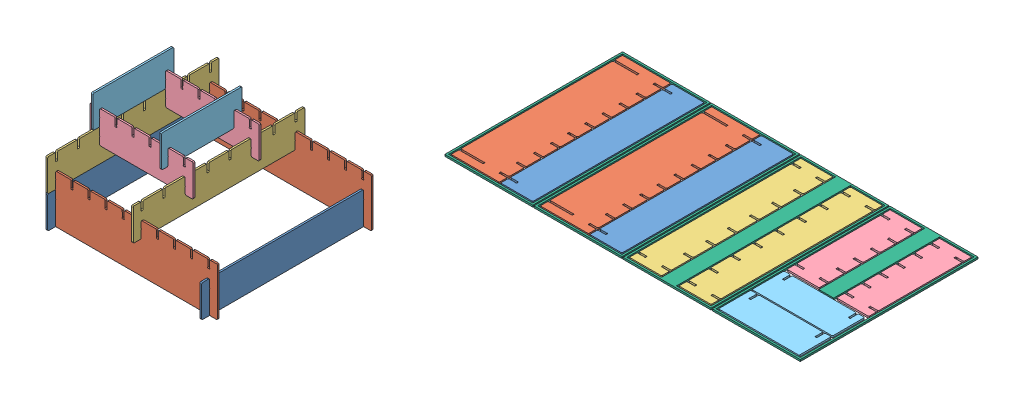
SolidWorks assembly grogrid.SLDASM, configuration Default (file format 8000). Lengths in mm.
Overall size (3424.06 662.4 3027.4).
21 component instances, 6 part files, 60 mates.
Components (placement in the parent):
- front-1: front.SLDPRT [Défaut] at (973.95 0 -1198.5) x (0 0 1) z (0 1 0) size (1177 220.8 12)
- side-1: side.SLDPRT [Défaut] at (633.75 12 -21.5) x (0 0 -1) z (0 -1 0) size (1177 331.2 12)
- front_level1-1: front_level1.SLDPRT [Défaut] at (1585.95 0 -1198.5) x (0 0 1) z (0 1 0) size (1177 220.8 12)
- front-2: front.SLDPRT [Défaut] at (361.95 0 -1198.5) x (0 0 1) z (0 1 0) size (1177 220.8 12)
- side-2: side.SLDPRT [Défaut] at (21.75 12 -21.5) x (0 0 -1) z (0 -1 0) size (1177 331.2 12)
- front_level1-2: front_level1.SLDPRT [Défaut] at (1466.55 0 -21.5) x (0 0 -1) z (0 1 0) size (1177 220.8 12)
- part_level2-1: part_level2.SLDPRT [Défaut] at (2078.55 0 -491.2778) x (0 0 -1) z (0 1 0) size (707.22 220.8 12)
- part_level3-1: part_level3.SLDPRT [Défaut] at (1857.75 12 -471.6) x (1 0 0) z (0 -1 0) size (553 220.8 12)
- part_level2-3: part_level2.SLDPRT [Défaut] at (2197.95 0 -1198.5) x (0 0 1) z (0 1 0) size (707.22 220.8 12)
- part_level3-2: part_level3.SLDPRT [Défaut] at (1857.75 12 -242.3) x (1 0 0) z (0 -1 0) size (553 220.8 12)
- layout-1: layout.SLDPRT [Default] at (0.25 0 0) size (2440 12 1220)
- front-3: front.SLDPRT [Défaut] at (-929.8123 220.8 630.4026) x (0 0 1) z (1 0 0) size (1177 220.8 12)
- front-4: front.SLDPRT [Défaut] at (127.1877 220.8 630.4026) x (0 0 1) z (1 0 0) size (1177 220.8 12)
- side-3: side.SLDPRT [Défaut] at (-983.8123 0 1741.4026) size (1177 331.2 12)
- side-4: side.SLDPRT [Défaut] at (-983.8123 0 684.4026) size (1177 331.2 12)
- front_level1-3: front_level1.SLDPRT [Défaut] at (-330.5901 441.6 1807.4026) x (0 0 -1) z (-1 0 0) size (1177 220.8 12)
- front_level1-4: front_level1.SLDPRT [Défaut] at (-917.8123 441.6 1807.4026) x (0 0 -1) z (-1 0 0) size (1177 220.8 12)
- part_level2-4: part_level2.SLDPRT [Défaut] at (-983.8123 552 998.4026) x (1 0 0) z (0 0 -1) size (707.22 220.8 12)
- part_level2-5: part_level2.SLDPRT [Défaut] at (-983.8123 552 1451.4026) x (1 0 0) z (0 0 -1) size (707.22 220.8 12)
- part_level3-3: part_level3.SLDPRT [Défaut] at (-917.8123 441.6 942.4026) x (0 0 1) z (-1 0 0) size (553 220.8 12)
- part_level3-4: part_level3.SLDPRT [Défaut] at (-448.0346 441.6 942.4026) x (0 0 1) z (-1 0 0) size (553 220.8 12)
Mates (geometry in assembly coordinates):
- Coincident2: coincident anti-aligned: plane of front-1 through (973.95 0 -1198.5) normal (0 -1 0); plane of assembly through (0 0 0) normal (0 1 0)
- Coincident3: coincident anti-aligned: plane of part_level3-1 through (1857.75 0 -471.6) normal (0 -1 0); plane of assembly through (0 0 0) normal (0 1 0)
- Coincident4: coincident anti-aligned: plane of side-2 through (21.75 0 -21.5) normal (0 -1 0); plane of assembly through (0 0 0) normal (0 1 0)
- Coincident5: coincident anti-aligned: plane of part_level2-3 through (2197.95 0 -1198.5) normal (0 -1 0); plane of assembly through (0 0 0) normal (0 1 0)
- Coincident6: coincident anti-aligned: plane of part_level3-2 through (1857.75 0 -242.3) normal (0 -1 0); plane of assembly through (0 0 0) normal (0 1 0)
- Coincident7: coincident anti-aligned: plane of front_level1-1 through (1585.95 0 -1198.5) normal (0 -1 0); plane of assembly through (0 0 0) normal (0 1 0)
- Coincident8: coincident anti-aligned: plane of side-1 through (633.75 0 -21.5) normal (0 -1 0); plane of assembly through (0 0 0) normal (0 1 0)
- Coincident9: coincident anti-aligned: plane of front_level1-2 through (1466.55 0 -21.5) normal (0 -1 0); plane of assembly through (0 0 0) normal (0 1 0)
- Coincident10: coincident anti-aligned: plane of part_level2-1 through (2078.55 0 -491.2778) normal (0 -1 0); plane of assembly through (0 0 0) normal (0 1 0)
- Coincident11: coincident anti-aligned: plane of front-2 through (361.95 0 -1198.5) normal (0 -1 0); plane of assembly through (0 0 0) normal (0 1 0)
- Coincident14: coincident anti-aligned: line of side-2 through (345.95 0 -1198.5) axis (-1 0 0); line of layout-1 through (21.75 0 -1198.5) axis (1 0 0)
- Coincident15: coincident anti-aligned: line of side-2 through (21.75 0 -94.9831) axis (0 0 -1); line of layout-1 through (21.75 0 -1198.5) axis (0 0 1)
- Coincident16: coincident anti-aligned: line of front-2 through (582.75 0 -28.5) axis (0 0 -1); line of layout-1 through (582.75 0 -1198.5) axis (0 0 1)
- Coincident17: coincident anti-aligned: line of front-2 through (575.75 0 -1198.5) axis (-1 0 0); line of layout-1 through (21.75 0 -1198.5) axis (1 0 0)
- Coincident18: coincident anti-aligned: line of side-1 through (633.75 0 -94.9831) axis (0 0 -1); line of layout-1 through (633.75 0 -1198.5) axis (0 0 1)
- Coincident19: coincident anti-aligned: line of side-1 through (957.95 0 -1198.5) axis (-1 0 0); line of layout-1 through (633.75 0 -1198.5) axis (1 0 0)
- Coincident21: coincident anti-aligned: line of front-1 through (1194.75 0 -28.5) axis (0 0 -1); line of layout-1 through (1194.75 0 -1198.5) axis (0 0 1)
- Coincident22: coincident anti-aligned: line of front-1 through (1187.75 0 -1198.5) axis (-1 0 0); line of layout-1 through (633.75 0 -1198.5) axis (1 0 0)
- Coincident23: coincident anti-aligned: line of front_level1-2 through (1245.75 0 -1125.0505) axis (0 0 1); line of layout-1 through (1245.75 0 -21.5) axis (0 0 -1)
- Coincident24: coincident aligned: line of front_level1-2 through (1252.75 0 -1198.5) axis (1 0 0); line of layout-1 through (1245.75 0 -1198.5) axis (1 0 0)
- Coincident25: coincident aligned: line of front_level1-1 through (1806.75 0 -94.9495) axis (0 0 -1); line of layout-1 through (1806.75 0 -21.5) axis (0 0 -1)
- Coincident26: coincident anti-aligned: line of front_level1-1 through (1799.75 0 -1198.5) axis (-1 0 0); line of layout-1 through (1245.75 0 -1198.5) axis (1 0 0)
- Coincident27: coincident aligned: line of part_level2-1 through (1857.75 0 -1125.0505) axis (0 0 1); line of layout-1 through (1857.75 0 -1198.5) axis (0 0 1)
- Coincident28: coincident aligned: line of part_level2-1 through (1864.75 0 -1198.5) axis (1 0 0); line of layout-1 through (1857.75 0 -1198.5) axis (1 0 0)
- Coincident29: coincident anti-aligned: line of part_level2-3 through (2418.75 0 -564.7272) axis (0 0 -1); line of layout-1 through (2418.75 0 -1198.5) axis (0 0 1)
- Coincident30: coincident anti-aligned: line of part_level2-3 through (2411.75 0 -1198.5) axis (-1 0 0); line of layout-1 through (1857.75 0 -1198.5) axis (1 0 0)
- Coincident31: coincident anti-aligned: line of part_level3-2 through (2403.75 0 -21.5) axis (-1 0 0); line of layout-1 through (1857.75 0 -21.5) axis (1 0 0)
- Coincident32: coincident anti-aligned: line of part_level3-2 through (1857.75 0 -28.5) axis (0 0 -1); line of layout-1 through (1857.75 0 -1198.5) axis (0 0 1)
- Distance3: distance anti-aligned: plane of part_level3-1 through (1857.75 0 -250.8) normal (0 0 1); plane of part_level3-2 through (1857.75 0 -242.3) normal (0 0 -1)
- Coincident34: coincident anti-aligned: line of part_level3-1 through (1857.75 0 -257.8) axis (0 0 -1); line of layout-1 through (1857.75 0 -1198.5) axis (0 0 1)
- Coincident35: coordinate: point of ?; point of assembly
- Coincident36: coincident anti-aligned: plane of front-3 through (-917.8123 0 630.4026) normal (0 -1 0); plane of assembly through (0 0 0) normal (0 1 0)
- Parallel1: parallel aligned: plane of front-3 through (-917.8123 220.8 630.4026) normal (1 0 0); plane of assembly through (0 0 0) normal (1 0 0)
- Coincident38: coincident anti-aligned: plane of front-4 through (139.1877 0 630.4026) normal (0 -1 0); plane of assembly through (0 0 0) normal (0 1 0)
- Coincident39: coincident aligned: plane of front-3 through (-917.8123 220.8 1807.4026) normal (0 0 1); plane of front-4 through (139.1877 220.8 1807.4026) normal (0 0 1)
- Width2: width anti-aligned: plane of front-3 through (-929.8123 172.094 1741.2556) normal (0 0.007246 0.999974); plane of front-3 through (-929.8123 172.094 1753.5497) normal (0 0.007246 -0.999974); plane of side-3 through (-983.8123 0 1753.4026) normal (0 0 1); plane of side-3 through (-983.8123 0 1741.4026) normal (0 0 -1)
- Coincident40: coincident anti-aligned: plane of front-3 through (-929.8123 165.6 1747.5353) normal (0 1 0); plane of side-3 through (-923.945 165.6 1741.4026) normal (0 -1 0)
- Width3: width aligned: plane of front-3 through (-917.8123 220.8 630.4026) normal (1 0 0); plane of front-3 through (-929.8123 220.8 630.4026) normal (-1 0 0); plane of side-3 through (-917.6966 159.0758 1741.4026) normal (-0.999997 -0.002415 0); plane of side-3 through (-929.9281 159.0758 1741.4026) normal (0.999997 -0.002415 0)
- Width4: width aligned: plane of side-3 through (139.3034 159.0758 1741.4026) normal (-0.999997 -0.002415 0); plane of side-3 through (127.0719 159.0758 1741.4026) normal (0.999997 -0.002415 0); plane of front-4 through (139.1877 220.8 630.4026) normal (1 0 0); plane of front-4 through (127.1877 220.8 630.4026) normal (-1 0 0)
- Width6: width anti-aligned: plane of side-4 through (-929.9281 159.0758 684.4026) normal (0.999997 -0.002415 0); plane of side-4 through (-917.6966 159.0758 684.4026) normal (-0.999997 -0.002415 0); plane of front-3 through (-917.8123 220.8 630.4026) normal (1 0 0); plane of front-3 through (-929.8123 220.8 630.4026) normal (-1 0 0)
- Width7: width anti-aligned: plane of front-3 through (-929.8123 172.094 684.2556) normal (0 0.007246 0.999974); plane of front-3 through (-929.8123 172.094 696.5497) normal (0 0.007246 -0.999974); plane of side-4 through (-983.8123 0 696.4026) normal (0 0 1); plane of side-4 through (-983.8123 0 684.4026) normal (0 0 -1)
- Coincident41: coincident anti-aligned: plane of front-3 through (-929.8123 165.6 690.27) normal (0 1 0); plane of side-4 through (-923.945 165.6 684.4026) normal (0 -1 0)
- Width8: width anti-aligned: plane of front_level1-3 through (-330.5901 269.506 1741.2556) normal (0 -0.007246 0.999974); plane of front_level1-3 through (-330.5901 269.506 1753.5497) normal (0 -0.007246 -0.999974); plane of side-3 through (-983.8123 0 1753.4026) normal (0 0 1); plane of side-3 through (-983.8123 0 1741.4026) normal (0 0 -1)
- Coincident42: coincident anti-aligned: plane of side-3 through (-336.7228 276 1753.4026) normal (0 1 0); plane of front_level1-3 through (-330.5901 276 1747.5353) normal (0 -1 0)
- Width10: width aligned: plane of side-3 through (-342.7372 282.494 1753.4026) normal (0.999974 0.007246 0); plane of side-3 through (-330.4431 282.494 1753.4026) normal (-0.999974 0.007246 0); plane of front_level1-3 through (-342.5901 441.6 1807.4026) normal (-1 0 0); plane of front_level1-3 through (-330.5901 441.6 1807.4026) normal (1 0 0)
- Width11: width aligned: plane of side-4 through (-929.9594 282.494 696.4026) normal (0.999974 0.007246 0); plane of side-4 through (-917.6653 282.494 696.4026) normal (-0.999974 0.007246 0); plane of front_level1-4 through (-929.8123 441.6 1807.4026) normal (-1 0 0); plane of front_level1-4 through (-917.8123 441.6 1807.4026) normal (1 0 0)
- Width12: width aligned: plane of front_level1-4 through (-917.8123 269.506 696.5497) normal (0 -0.007246 -0.999974); plane of front_level1-4 through (-917.8123 269.506 684.2556) normal (0 -0.007246 0.999974); plane of side-4 through (-983.8123 0 696.4026) normal (0 0 1); plane of side-4 through (-983.8123 0 684.4026) normal (0 0 -1)
- Coincident43: coincident anti-aligned: plane of side-4 through (-923.6797 276 696.4026) normal (0 1 0); plane of front_level1-4 through (-917.8123 276 690.27) normal (0 -1 0)
- Width13: width anti-aligned: plane of front_level1-3 through (-330.5901 392.894 998.5497) normal (0 0.007246 -0.999974); plane of front_level1-3 through (-330.5901 392.894 986.2556) normal (0 0.007246 0.999974); plane of part_level2-4 through (-983.8123 552 986.4026) normal (0 0 -1); plane of part_level2-4 through (-983.8123 552 998.4026) normal (0 0 1)
- Coincident44: coincident anti-aligned: plane of front_level1-4 through (-917.8123 386.4 992.27) normal (0 1 0); plane of part_level2-4 through (-923.945 386.4 998.4026) normal (0 -1 0)
- Width14: width aligned: plane of part_level2-4 through (-917.6653 379.906 998.4026) normal (-0.999974 -0.007246 0); plane of part_level2-4 through (-929.9594 379.906 998.4026) normal (0.999974 -0.007246 0); plane of front_level1-4 through (-917.8123 441.6 1807.4026) normal (1 0 0); plane of front_level1-4 through (-929.8123 441.6 1807.4026) normal (-1 0 0)
- Width15: width aligned: plane of part_level2-5 through (-917.6653 379.906 1451.4026) normal (-0.999974 -0.007246 0); plane of part_level2-5 through (-929.9594 379.906 1451.4026) normal (0.999974 -0.007246 0); plane of front_level1-4 through (-917.8123 441.6 1807.4026) normal (1 0 0); plane of front_level1-4 through (-929.8123 441.6 1807.4026) normal (-1 0 0)
- Width16: width aligned: plane of front_level1-4 through (-917.8123 392.894 1451.5497) normal (0 0.007246 -0.999974); plane of front_level1-4 through (-917.8123 392.894 1439.2556) normal (0 0.007246 0.999974); plane of part_level2-5 through (-983.8123 552 1451.4026) normal (0 0 1); plane of part_level2-5 through (-983.8123 552 1439.4026) normal (0 0 -1)
- Coincident45: coincident anti-aligned: plane of front_level1-4 through (-917.8123 386.4 1445.5353) normal (0 1 0); plane of part_level2-5 through (-923.945 386.4 1451.4026) normal (0 -1 0)
- Coincident46: coincident anti-aligned: plane of part_level2-4 through (-923.945 496.8 998.4026) normal (0 1 0); plane of part_level3-3 through (-917.8123 496.8 992.27) normal (0 -1 0)
- Width17: width anti-aligned: plane of part_level2-4 through (-929.9594 503.294 998.4026) normal (0.999974 0.007246 0); plane of part_level2-4 through (-917.6653 503.294 998.4026) normal (-0.999974 0.007246 0); plane of part_level3-3 through (-917.8123 441.6 942.4026) normal (1 0 0); plane of part_level3-3 through (-929.8123 441.6 942.4026) normal (-1 0 0)
- Width18: width anti-aligned: plane of part_level3-3 through (-917.8123 490.306 998.5497) normal (0 -0.007246 -0.999974); plane of part_level3-3 through (-917.8123 490.306 986.2556) normal (0 -0.007246 0.999974); plane of part_level2-4 through (-983.8123 552 986.4026) normal (0 0 -1); plane of part_level2-4 through (-983.8123 552 998.4026) normal (0 0 1)
- Coincident47: coincident anti-aligned: plane of part_level2-4 through (-453.9019 496.8 998.4026) normal (0 1 0); plane of part_level3-4 through (-448.0346 496.8 992.27) normal (0 -1 0)
- Width19: width aligned: plane of part_level2-4 through (-460.1816 503.294 998.4026) normal (0.999974 0.007246 0); plane of part_level2-4 through (-447.8875 503.294 998.4026) normal (-0.999974 0.007246 0); plane of part_level3-4 through (-460.0346 441.6 942.4026) normal (-1 0 0); plane of part_level3-4 through (-448.0346 441.6 942.4026) normal (1 0 0)
- Width20: width aligned: plane of part_level3-4 through (-448.0346 490.306 998.5497) normal (0 -0.007246 -0.999974); plane of part_level3-4 through (-448.0346 490.306 986.2556) normal (0 -0.007246 0.999974); plane of part_level2-4 through (-983.8123 552 998.4026) normal (0 0 1); plane of part_level2-4 through (-983.8123 552 986.4026) normal (0 0 -1)
